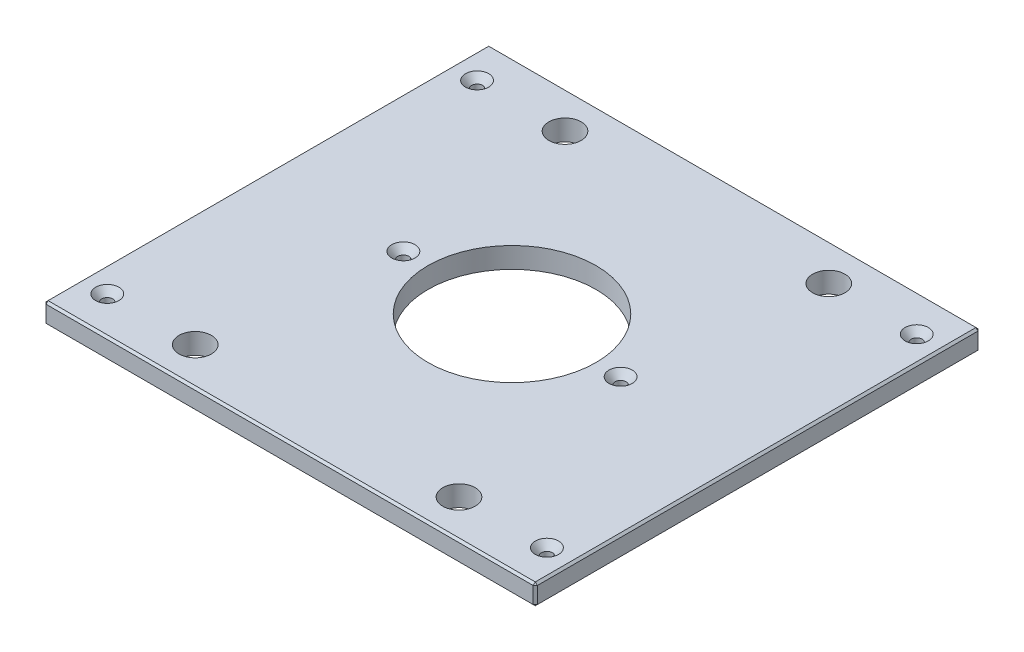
ISO-10303-21;
HEADER;
FILE_DESCRIPTION(('STEP AP214'),'2;1');
FILE_NAME('part.step','',(''),(''),'','','');
FILE_SCHEMA(('AUTOMOTIVE_DESIGN { 1 0 10303 214 1 1 1 1 }'));
ENDSEC;
DATA;
#1=APPLICATION_CONTEXT('core data for automotive mechanical design processes');
#2=APPLICATION_PROTOCOL_DEFINITION('international standard','automotive_design',2000,#1);
#3=PRODUCT_CONTEXT('',#1,'mechanical');
#4=PRODUCT('Part','Part','',(#3));
#5=PRODUCT_RELATED_PRODUCT_CATEGORY('part','',(#4));
#6=PRODUCT_DEFINITION_FORMATION('','',#4);
#7=PRODUCT_DEFINITION_CONTEXT('part definition',#1,'design');
#8=PRODUCT_DEFINITION('design','',#6,#7);
#9=PRODUCT_DEFINITION_SHAPE('','',#8);
#10=(LENGTH_UNIT() NAMED_UNIT(*) SI_UNIT(.MILLI.,.METRE.));
#11=(NAMED_UNIT(*) PLANE_ANGLE_UNIT() SI_UNIT($,.RADIAN.));
#12=(NAMED_UNIT(*) SI_UNIT($,.STERADIAN.) SOLID_ANGLE_UNIT());
#13=UNCERTAINTY_MEASURE_WITH_UNIT(LENGTH_MEASURE(1.E-05),#10,'distance_accuracy_value','');
#14=(GEOMETRIC_REPRESENTATION_CONTEXT(3) GLOBAL_UNCERTAINTY_ASSIGNED_CONTEXT((#13)) GLOBAL_UNIT_ASSIGNED_CONTEXT((#10,
#11,#12)) REPRESENTATION_CONTEXT('',''));
#15=CARTESIAN_POINT('',(0.,0.,0.));
#16=DIRECTION('',(0.,0.,1.));
#17=DIRECTION('',(1.,0.,0.));
#18=AXIS2_PLACEMENT_3D('',#15,#16,#17);
#19=CARTESIAN_POINT('',(-150.8125,12.7,-136.525));
#20=DIRECTION('',(1.,0.,0.));
#21=DIRECTION('',(0.,0.,-1.));
#22=AXIS2_PLACEMENT_3D('',#19,#20,#21);
#23=PLANE('',#22);
#24=DIRECTION('',(0.,0.,-1.));
#25=VECTOR('',#24,1.);
#26=CARTESIAN_POINT('',(-150.8125,11.43,-136.525));
#27=LINE('',#26,#25);
#28=CARTESIAN_POINT('',(-150.8125,11.43,135.255));
#29=VERTEX_POINT('',#28);
#30=CARTESIAN_POINT('',(-150.8125,11.43,-135.255));
#31=VERTEX_POINT('',#30);
#32=EDGE_CURVE('E136',#29,#31,#27,.T.);
#33=ORIENTED_EDGE('',*,*,#32,.T.);
#34=DIRECTION('',(0.,-1.,0.));
#35=VECTOR('',#34,1.);
#36=CARTESIAN_POINT('',(-150.8125,12.7,-135.255));
#37=LINE('',#36,#35);
#38=CARTESIAN_POINT('',(-150.8125,1.26999999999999,-135.255));
#39=VERTEX_POINT('',#38);
#40=EDGE_CURVE('E132',#31,#39,#37,.T.);
#41=ORIENTED_EDGE('',*,*,#40,.T.);
#42=DIRECTION('',(0.,0.,1.));
#43=VECTOR('',#42,1.);
#44=CARTESIAN_POINT('',(-150.8125,1.26999999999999,-136.525));
#45=LINE('',#44,#43);
#46=CARTESIAN_POINT('',(-150.8125,1.26999999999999,135.255));
#47=VERTEX_POINT('',#46);
#48=EDGE_CURVE('E127',#39,#47,#45,.T.);
#49=ORIENTED_EDGE('',*,*,#48,.T.);
#50=DIRECTION('',(0.,1.,0.));
#51=VECTOR('',#50,1.);
#52=CARTESIAN_POINT('',(-150.8125,12.7,135.255));
#53=LINE('',#52,#51);
#54=EDGE_CURVE('E129',#47,#29,#53,.T.);
#55=ORIENTED_EDGE('',*,*,#54,.T.);
#56=EDGE_LOOP('',(#33,#41,#49,#55));
#57=FACE_BOUND('',#56,.T.);
#58=ADVANCED_FACE('F36',(#57),#23,.F.);
#59=CARTESIAN_POINT('',(-150.8125,12.7,136.525));
#60=DIRECTION('',(0.,0.,-1.));
#61=DIRECTION('',(-1.,0.,0.));
#62=AXIS2_PLACEMENT_3D('',#59,#60,#61);
#63=PLANE('',#62);
#64=DIRECTION('',(1.,0.,0.));
#65=VECTOR('',#64,1.);
#66=CARTESIAN_POINT('',(-150.8125,1.26999999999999,136.525));
#67=LINE('',#66,#65);
#68=CARTESIAN_POINT('',(-149.5425,1.26999999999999,136.525));
#69=VERTEX_POINT('',#68);
#70=CARTESIAN_POINT('',(149.5425,1.26999999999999,136.525));
#71=VERTEX_POINT('',#70);
#72=EDGE_CURVE('E59',#69,#71,#67,.T.);
#73=ORIENTED_EDGE('',*,*,#72,.T.);
#74=DIRECTION('',(0.,1.,0.));
#75=VECTOR('',#74,1.);
#76=CARTESIAN_POINT('',(149.5425,12.7,136.525));
#77=LINE('',#76,#75);
#78=CARTESIAN_POINT('',(149.5425,11.43,136.525));
#79=VERTEX_POINT('',#78);
#80=EDGE_CURVE('E11',#71,#79,#77,.T.);
#81=ORIENTED_EDGE('',*,*,#80,.T.);
#82=DIRECTION('',(-1.,0.,0.));
#83=VECTOR('',#82,1.);
#84=CARTESIAN_POINT('',(-150.8125,11.43,136.525));
#85=LINE('',#84,#83);
#86=CARTESIAN_POINT('',(-149.5425,11.43,136.525));
#87=VERTEX_POINT('',#86);
#88=EDGE_CURVE('E45',#79,#87,#85,.T.);
#89=ORIENTED_EDGE('',*,*,#88,.T.);
#90=DIRECTION('',(0.,-1.,0.));
#91=VECTOR('',#90,1.);
#92=CARTESIAN_POINT('',(-149.5425,12.7,136.525));
#93=LINE('',#92,#91);
#94=EDGE_CURVE('E280',#87,#69,#93,.T.);
#95=ORIENTED_EDGE('',*,*,#94,.T.);
#96=EDGE_LOOP('',(#73,#81,#89,#95));
#97=FACE_BOUND('',#96,.T.);
#98=ADVANCED_FACE('F349',(#97),#63,.F.);
#99=CARTESIAN_POINT('',(150.8125,12.7,-136.525));
#100=DIRECTION('',(-1.,0.,0.));
#101=DIRECTION('',(0.,0.,1.));
#102=AXIS2_PLACEMENT_3D('',#99,#100,#101);
#103=PLANE('',#102);
#104=DIRECTION('',(0.,0.,-1.));
#105=VECTOR('',#104,1.);
#106=CARTESIAN_POINT('',(150.8125,1.26999999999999,-136.525));
#107=LINE('',#106,#105);
#108=CARTESIAN_POINT('',(150.8125,1.26999999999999,135.255));
#109=VERTEX_POINT('',#108);
#110=CARTESIAN_POINT('',(150.8125,1.26999999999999,-135.255));
#111=VERTEX_POINT('',#110);
#112=EDGE_CURVE('E275',#109,#111,#107,.T.);
#113=ORIENTED_EDGE('',*,*,#112,.T.);
#114=DIRECTION('',(0.,1.,0.));
#115=VECTOR('',#114,1.);
#116=CARTESIAN_POINT('',(150.8125,12.7,-135.255));
#117=LINE('',#116,#115);
#118=CARTESIAN_POINT('',(150.8125,11.43,-135.255));
#119=VERTEX_POINT('',#118);
#120=EDGE_CURVE('E277',#111,#119,#117,.T.);
#121=ORIENTED_EDGE('',*,*,#120,.T.);
#122=DIRECTION('',(0.,0.,1.));
#123=VECTOR('',#122,1.);
#124=CARTESIAN_POINT('',(150.8125,11.43,136.525));
#125=LINE('',#124,#123);
#126=CARTESIAN_POINT('',(150.8125,11.43,135.255));
#127=VERTEX_POINT('',#126);
#128=EDGE_CURVE('E273',#119,#127,#125,.T.);
#129=ORIENTED_EDGE('',*,*,#128,.T.);
#130=DIRECTION('',(0.,-1.,0.));
#131=VECTOR('',#130,1.);
#132=CARTESIAN_POINT('',(150.8125,12.7,135.255));
#133=LINE('',#132,#131);
#134=EDGE_CURVE('E271',#127,#109,#133,.T.);
#135=ORIENTED_EDGE('',*,*,#134,.T.);
#136=EDGE_LOOP('',(#113,#121,#129,#135));
#137=FACE_BOUND('',#136,.T.);
#138=ADVANCED_FACE('F336',(#137),#103,.F.);
#139=CARTESIAN_POINT('',(-150.8125,12.7,-136.525));
#140=DIRECTION('',(0.,0.,1.));
#141=DIRECTION('',(1.,0.,0.));
#142=AXIS2_PLACEMENT_3D('',#139,#140,#141);
#143=PLANE('',#142);
#144=DIRECTION('',(-1.,0.,0.));
#145=VECTOR('',#144,1.);
#146=CARTESIAN_POINT('',(-150.8125,1.26999999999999,-136.525));
#147=LINE('',#146,#145);
#148=CARTESIAN_POINT('',(149.5425,1.26999999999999,-136.525));
#149=VERTEX_POINT('',#148);
#150=CARTESIAN_POINT('',(-149.5425,1.26999999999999,-136.525));
#151=VERTEX_POINT('',#150);
#152=EDGE_CURVE('E247',#149,#151,#147,.T.);
#153=ORIENTED_EDGE('',*,*,#152,.T.);
#154=DIRECTION('',(0.,1.,0.));
#155=VECTOR('',#154,1.);
#156=CARTESIAN_POINT('',(-149.5425,12.7,-136.525));
#157=LINE('',#156,#155);
#158=CARTESIAN_POINT('',(-149.5425,11.43,-136.525));
#159=VERTEX_POINT('',#158);
#160=EDGE_CURVE('E251',#151,#159,#157,.T.);
#161=ORIENTED_EDGE('',*,*,#160,.T.);
#162=DIRECTION('',(1.,0.,0.));
#163=VECTOR('',#162,1.);
#164=CARTESIAN_POINT('',(150.8125,11.43,-136.525));
#165=LINE('',#164,#163);
#166=CARTESIAN_POINT('',(149.5425,11.43,-136.525));
#167=VERTEX_POINT('',#166);
#168=EDGE_CURVE('E249',#159,#167,#165,.T.);
#169=ORIENTED_EDGE('',*,*,#168,.T.);
#170=DIRECTION('',(0.,-1.,0.));
#171=VECTOR('',#170,1.);
#172=CARTESIAN_POINT('',(149.5425,12.7,-136.525));
#173=LINE('',#172,#171);
#174=EDGE_CURVE('E245',#167,#149,#173,.T.);
#175=ORIENTED_EDGE('',*,*,#174,.T.);
#176=EDGE_LOOP('',(#153,#161,#169,#175));
#177=FACE_BOUND('',#176,.T.);
#178=ADVANCED_FACE('F310',(#177),#143,.F.);
#179=CARTESIAN_POINT('',(0.,12.7,0.));
#180=DIRECTION('',(0.,1.,0.));
#181=DIRECTION('',(0.,0.,1.));
#182=AXIS2_PLACEMENT_3D('',#179,#180,#181);
#183=PLANE('',#182);
#184=CARTESIAN_POINT('',(134.9375,12.7,-113.50498));
#185=DIRECTION('',(0.,1.,0.));
#186=DIRECTION('',(0.,0.,1.));
#187=AXIS2_PLACEMENT_3D('',#184,#185,#186);
#188=CIRCLE('',#187,7.13739999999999);
#189=CARTESIAN_POINT('',(134.9375,12.7,-106.36758));
#190=VERTEX_POINT('',#189);
#191=EDGE_CURVE('E753',#190,#190,#188,.T.);
#192=ORIENTED_EDGE('',*,*,#191,.F.);
#193=EDGE_LOOP('',(#192));
#194=FACE_BOUND('',#193,.T.);
#195=CARTESIAN_POINT('',(134.9375,12.7,113.50498));
#196=DIRECTION('',(0.,1.,0.));
#197=DIRECTION('',(0.,0.,1.));
#198=AXIS2_PLACEMENT_3D('',#195,#196,#197);
#199=CIRCLE('',#198,7.13739999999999);
#200=CARTESIAN_POINT('',(134.9375,12.7,120.64238));
#201=VERTEX_POINT('',#200);
#202=EDGE_CURVE('E757',#201,#201,#199,.T.);
#203=ORIENTED_EDGE('',*,*,#202,.F.);
#204=EDGE_LOOP('',(#203));
#205=FACE_BOUND('',#204,.T.);
#206=CARTESIAN_POINT('',(-134.9375,12.7,113.50498));
#207=DIRECTION('',(0.,1.,0.));
#208=DIRECTION('',(0.,0.,1.));
#209=AXIS2_PLACEMENT_3D('',#206,#207,#208);
#210=CIRCLE('',#209,7.13739999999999);
#211=CARTESIAN_POINT('',(-134.9375,12.7,120.64238));
#212=VERTEX_POINT('',#211);
#213=EDGE_CURVE('E761',#212,#212,#210,.T.);
#214=ORIENTED_EDGE('',*,*,#213,.F.);
#215=EDGE_LOOP('',(#214));
#216=FACE_BOUND('',#215,.T.);
#217=CARTESIAN_POINT('',(-66.675,12.7,0.));
#218=DIRECTION('',(0.,1.,0.));
#219=DIRECTION('',(0.,0.,1.));
#220=AXIS2_PLACEMENT_3D('',#217,#218,#219);
#221=CIRCLE('',#220,7.1374);
#222=CARTESIAN_POINT('',(-66.675,12.7,7.1374));
#223=VERTEX_POINT('',#222);
#224=EDGE_CURVE('E765',#223,#223,#221,.T.);
#225=ORIENTED_EDGE('',*,*,#224,.F.);
#226=EDGE_LOOP('',(#225));
#227=FACE_BOUND('',#226,.T.);
#228=CARTESIAN_POINT('',(66.675,12.7,0.));
#229=DIRECTION('',(0.,1.,0.));
#230=DIRECTION('',(0.,0.,1.));
#231=AXIS2_PLACEMENT_3D('',#228,#229,#230);
#232=CIRCLE('',#231,7.1374);
#233=CARTESIAN_POINT('',(66.675,12.7,7.1374));
#234=VERTEX_POINT('',#233);
#235=EDGE_CURVE('E769',#234,#234,#232,.T.);
#236=ORIENTED_EDGE('',*,*,#235,.F.);
#237=EDGE_LOOP('',(#236));
#238=FACE_BOUND('',#237,.T.);
#239=CARTESIAN_POINT('',(-134.9375,12.7,-113.50498));
#240=DIRECTION('',(0.,1.,0.));
#241=DIRECTION('',(0.,0.,1.));
#242=AXIS2_PLACEMENT_3D('',#239,#240,#241);
#243=CIRCLE('',#242,7.13739999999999);
#244=CARTESIAN_POINT('',(-134.9375,12.7,-106.36758));
#245=VERTEX_POINT('',#244);
#246=EDGE_CURVE('E772',#245,#245,#243,.T.);
#247=ORIENTED_EDGE('',*,*,#246,.F.);
#248=EDGE_LOOP('',(#247));
#249=FACE_BOUND('',#248,.T.);
#250=DIRECTION('',(0.,0.,-1.));
#251=VECTOR('',#250,1.);
#252=CARTESIAN_POINT('',(149.5425,12.7,-136.525));
#253=LINE('',#252,#251);
#254=CARTESIAN_POINT('',(149.5425,12.7,135.255));
#255=VERTEX_POINT('',#254);
#256=CARTESIAN_POINT('',(149.5425,12.7,-135.255));
#257=VERTEX_POINT('',#256);
#258=EDGE_CURVE('E258',#255,#257,#253,.T.);
#259=ORIENTED_EDGE('',*,*,#258,.T.);
#260=DIRECTION('',(-1.,0.,0.));
#261=VECTOR('',#260,1.);
#262=CARTESIAN_POINT('',(-150.8125,12.7,-135.255));
#263=LINE('',#262,#261);
#264=CARTESIAN_POINT('',(-149.5425,12.7,-135.255));
#265=VERTEX_POINT('',#264);
#266=EDGE_CURVE('E260',#257,#265,#263,.T.);
#267=ORIENTED_EDGE('',*,*,#266,.T.);
#268=DIRECTION('',(0.,0.,1.));
#269=VECTOR('',#268,1.);
#270=CARTESIAN_POINT('',(-149.5425,12.7,136.525));
#271=LINE('',#270,#269);
#272=CARTESIAN_POINT('',(-149.5425,12.7,135.255));
#273=VERTEX_POINT('',#272);
#274=EDGE_CURVE('E256',#265,#273,#271,.T.);
#275=ORIENTED_EDGE('',*,*,#274,.T.);
#276=DIRECTION('',(1.,0.,0.));
#277=VECTOR('',#276,1.);
#278=CARTESIAN_POINT('',(150.8125,12.7,135.255));
#279=LINE('',#278,#277);
#280=EDGE_CURVE('E254',#273,#255,#279,.T.);
#281=ORIENTED_EDGE('',*,*,#280,.T.);
#282=EDGE_LOOP('',(#259,#267,#275,#281));
#283=FACE_BOUND('',#282,.T.);
#284=CARTESIAN_POINT('',(80.9625,12.7,-113.50498));
#285=DIRECTION('',(0.,1.,0.));
#286=DIRECTION('',(0.,0.,1.));
#287=AXIS2_PLACEMENT_3D('',#284,#285,#286);
#288=CIRCLE('',#287,9.921875);
#289=CARTESIAN_POINT('',(80.9625,12.7,-103.583105));
#290=VERTEX_POINT('',#289);
#291=EDGE_CURVE('E205',#290,#290,#288,.T.);
#292=ORIENTED_EDGE('',*,*,#291,.F.);
#293=EDGE_LOOP('',(#292));
#294=FACE_BOUND('',#293,.T.);
#295=CARTESIAN_POINT('',(-80.9625,12.7,-113.50498));
#296=DIRECTION('',(0.,1.,0.));
#297=DIRECTION('',(0.,0.,1.));
#298=AXIS2_PLACEMENT_3D('',#295,#296,#297);
#299=CIRCLE('',#298,9.921875);
#300=CARTESIAN_POINT('',(-80.9625,12.7,-103.583105));
#301=VERTEX_POINT('',#300);
#302=EDGE_CURVE('E215',#301,#301,#299,.T.);
#303=ORIENTED_EDGE('',*,*,#302,.F.);
#304=EDGE_LOOP('',(#303));
#305=FACE_BOUND('',#304,.T.);
#306=CARTESIAN_POINT('',(80.9625,12.7,113.50498));
#307=DIRECTION('',(0.,1.,0.));
#308=DIRECTION('',(0.,0.,1.));
#309=AXIS2_PLACEMENT_3D('',#306,#307,#308);
#310=CIRCLE('',#309,9.921875);
#311=CARTESIAN_POINT('',(80.9625,12.7,123.426855));
#312=VERTEX_POINT('',#311);
#313=EDGE_CURVE('E226',#312,#312,#310,.T.);
#314=ORIENTED_EDGE('',*,*,#313,.F.);
#315=EDGE_LOOP('',(#314));
#316=FACE_BOUND('',#315,.T.);
#317=CARTESIAN_POINT('',(-80.9625,12.7,113.50498));
#318=DIRECTION('',(0.,1.,0.));
#319=DIRECTION('',(0.,0.,1.));
#320=AXIS2_PLACEMENT_3D('',#317,#318,#319);
#321=CIRCLE('',#320,9.921875);
#322=CARTESIAN_POINT('',(-80.9625,12.7,123.426855));
#323=VERTEX_POINT('',#322);
#324=EDGE_CURVE('E232',#323,#323,#321,.T.);
#325=ORIENTED_EDGE('',*,*,#324,.F.);
#326=EDGE_LOOP('',(#325));
#327=FACE_BOUND('',#326,.T.);
#328=CARTESIAN_POINT('',(0.,12.7,0.));
#329=DIRECTION('',(0.,1.,0.));
#330=DIRECTION('',(0.,0.,1.));
#331=AXIS2_PLACEMENT_3D('',#328,#329,#330);
#332=CIRCLE('',#331,51.562);
#333=CARTESIAN_POINT('',(0.,12.7,51.562));
#334=VERTEX_POINT('',#333);
#335=EDGE_CURVE('E238',#334,#334,#332,.T.);
#336=ORIENTED_EDGE('',*,*,#335,.F.);
#337=EDGE_LOOP('',(#336));
#338=FACE_BOUND('',#337,.T.);
#339=ADVANCED_FACE('F358',(#194,#205,#216,#227,#238,#249,#283,#294,#305,#316,#327,#338),#183,.T.);
#340=CARTESIAN_POINT('',(0.,0.,0.));
#341=DIRECTION('',(0.,1.,0.));
#342=DIRECTION('',(0.,0.,1.));
#343=AXIS2_PLACEMENT_3D('',#340,#341,#342);
#344=PLANE('',#343);
#345=CARTESIAN_POINT('',(134.9375,0.,-113.50498));
#346=DIRECTION('',(0.,1.,0.));
#347=DIRECTION('',(0.,0.,1.));
#348=AXIS2_PLACEMENT_3D('',#345,#346,#347);
#349=CIRCLE('',#348,3.3782);
#350=CARTESIAN_POINT('',(134.9375,0.,-110.12678));
#351=VERTEX_POINT('',#350);
#352=EDGE_CURVE('E806',#351,#351,#349,.T.);
#353=ORIENTED_EDGE('',*,*,#352,.T.);
#354=EDGE_LOOP('',(#353));
#355=FACE_BOUND('',#354,.T.);
#356=CARTESIAN_POINT('',(134.9375,0.,113.50498));
#357=DIRECTION('',(0.,1.,0.));
#358=DIRECTION('',(0.,0.,1.));
#359=AXIS2_PLACEMENT_3D('',#356,#357,#358);
#360=CIRCLE('',#359,3.3782);
#361=CARTESIAN_POINT('',(134.9375,0.,116.88318));
#362=VERTEX_POINT('',#361);
#363=EDGE_CURVE('E799',#362,#362,#360,.T.);
#364=ORIENTED_EDGE('',*,*,#363,.T.);
#365=EDGE_LOOP('',(#364));
#366=FACE_BOUND('',#365,.T.);
#367=CARTESIAN_POINT('',(-134.9375,0.,113.50498));
#368=DIRECTION('',(0.,1.,0.));
#369=DIRECTION('',(0.,0.,1.));
#370=AXIS2_PLACEMENT_3D('',#367,#368,#369);
#371=CIRCLE('',#370,3.3782);
#372=CARTESIAN_POINT('',(-134.9375,0.,116.88318));
#373=VERTEX_POINT('',#372);
#374=EDGE_CURVE('E792',#373,#373,#371,.T.);
#375=ORIENTED_EDGE('',*,*,#374,.T.);
#376=EDGE_LOOP('',(#375));
#377=FACE_BOUND('',#376,.T.);
#378=CARTESIAN_POINT('',(-66.675,0.,0.));
#379=DIRECTION('',(0.,1.,0.));
#380=DIRECTION('',(0.,0.,1.));
#381=AXIS2_PLACEMENT_3D('',#378,#379,#380);
#382=CIRCLE('',#381,3.3782);
#383=CARTESIAN_POINT('',(-66.675,0.,3.3782));
#384=VERTEX_POINT('',#383);
#385=EDGE_CURVE('E785',#384,#384,#382,.T.);
#386=ORIENTED_EDGE('',*,*,#385,.T.);
#387=EDGE_LOOP('',(#386));
#388=FACE_BOUND('',#387,.T.);
#389=CARTESIAN_POINT('',(66.675,0.,0.));
#390=DIRECTION('',(0.,1.,0.));
#391=DIRECTION('',(0.,0.,1.));
#392=AXIS2_PLACEMENT_3D('',#389,#390,#391);
#393=CIRCLE('',#392,3.3782);
#394=CARTESIAN_POINT('',(66.675,0.,3.3782));
#395=VERTEX_POINT('',#394);
#396=EDGE_CURVE('E775',#395,#395,#393,.T.);
#397=ORIENTED_EDGE('',*,*,#396,.T.);
#398=EDGE_LOOP('',(#397));
#399=FACE_BOUND('',#398,.T.);
#400=CARTESIAN_POINT('',(-134.9375,0.,-113.50498));
#401=DIRECTION('',(0.,1.,0.));
#402=DIRECTION('',(0.,0.,1.));
#403=AXIS2_PLACEMENT_3D('',#400,#401,#402);
#404=CIRCLE('',#403,3.3782);
#405=CARTESIAN_POINT('',(-134.9375,0.,-110.12678));
#406=VERTEX_POINT('',#405);
#407=EDGE_CURVE('E218',#406,#406,#404,.T.);
#408=ORIENTED_EDGE('',*,*,#407,.T.);
#409=EDGE_LOOP('',(#408));
#410=FACE_BOUND('',#409,.T.);
#411=DIRECTION('',(0.,0.,-1.));
#412=VECTOR('',#411,1.);
#413=CARTESIAN_POINT('',(-149.5425,0.,0.));
#414=LINE('',#413,#412);
#415=CARTESIAN_POINT('',(-149.5425,0.,135.255));
#416=VERTEX_POINT('',#415);
#417=CARTESIAN_POINT('',(-149.5425,0.,-135.255));
#418=VERTEX_POINT('',#417);
#419=EDGE_CURVE('E159',#416,#418,#414,.T.);
#420=ORIENTED_EDGE('',*,*,#419,.T.);
#421=DIRECTION('',(1.,0.,0.));
#422=VECTOR('',#421,1.);
#423=CARTESIAN_POINT('',(0.,0.,-135.255));
#424=LINE('',#423,#422);
#425=CARTESIAN_POINT('',(149.5425,0.,-135.255));
#426=VERTEX_POINT('',#425);
#427=EDGE_CURVE('E268',#418,#426,#424,.T.);
#428=ORIENTED_EDGE('',*,*,#427,.T.);
#429=DIRECTION('',(0.,0.,1.));
#430=VECTOR('',#429,1.);
#431=CARTESIAN_POINT('',(149.5425,0.,0.));
#432=LINE('',#431,#430);
#433=CARTESIAN_POINT('',(149.5425,0.,135.255));
#434=VERTEX_POINT('',#433);
#435=EDGE_CURVE('E266',#426,#434,#432,.T.);
#436=ORIENTED_EDGE('',*,*,#435,.T.);
#437=DIRECTION('',(-1.,0.,0.));
#438=VECTOR('',#437,1.);
#439=CARTESIAN_POINT('',(0.,0.,135.255));
#440=LINE('',#439,#438);
#441=EDGE_CURVE('E263',#434,#416,#440,.T.);
#442=ORIENTED_EDGE('',*,*,#441,.T.);
#443=EDGE_LOOP('',(#420,#428,#436,#442));
#444=FACE_BOUND('',#443,.T.);
#445=CARTESIAN_POINT('',(80.9625,0.,-113.50498));
#446=DIRECTION('',(0.,1.,0.));
#447=DIRECTION('',(0.,0.,1.));
#448=AXIS2_PLACEMENT_3D('',#445,#446,#447);
#449=CIRCLE('',#448,9.921875);
#450=CARTESIAN_POINT('',(80.9625,0.,-103.583105));
#451=VERTEX_POINT('',#450);
#452=EDGE_CURVE('E210',#451,#451,#449,.T.);
#453=ORIENTED_EDGE('',*,*,#452,.T.);
#454=EDGE_LOOP('',(#453));
#455=FACE_BOUND('',#454,.T.);
#456=CARTESIAN_POINT('',(-80.9625,0.,-113.50498));
#457=DIRECTION('',(0.,1.,0.));
#458=DIRECTION('',(0.,0.,1.));
#459=AXIS2_PLACEMENT_3D('',#456,#457,#458);
#460=CIRCLE('',#459,9.921875);
#461=CARTESIAN_POINT('',(-80.9625,0.,-103.583105));
#462=VERTEX_POINT('',#461);
#463=EDGE_CURVE('E223',#462,#462,#460,.T.);
#464=ORIENTED_EDGE('',*,*,#463,.T.);
#465=EDGE_LOOP('',(#464));
#466=FACE_BOUND('',#465,.T.);
#467=CARTESIAN_POINT('',(80.9625,0.,113.50498));
#468=DIRECTION('',(0.,1.,0.));
#469=DIRECTION('',(0.,0.,1.));
#470=AXIS2_PLACEMENT_3D('',#467,#468,#469);
#471=CIRCLE('',#470,9.921875);
#472=CARTESIAN_POINT('',(80.9625,0.,123.426855));
#473=VERTEX_POINT('',#472);
#474=EDGE_CURVE('E229',#473,#473,#471,.T.);
#475=ORIENTED_EDGE('',*,*,#474,.T.);
#476=EDGE_LOOP('',(#475));
#477=FACE_BOUND('',#476,.T.);
#478=CARTESIAN_POINT('',(-80.9625,0.,113.50498));
#479=DIRECTION('',(0.,1.,0.));
#480=DIRECTION('',(0.,0.,1.));
#481=AXIS2_PLACEMENT_3D('',#478,#479,#480);
#482=CIRCLE('',#481,9.921875);
#483=CARTESIAN_POINT('',(-80.9625,0.,123.426855));
#484=VERTEX_POINT('',#483);
#485=EDGE_CURVE('E235',#484,#484,#482,.T.);
#486=ORIENTED_EDGE('',*,*,#485,.T.);
#487=EDGE_LOOP('',(#486));
#488=FACE_BOUND('',#487,.T.);
#489=CARTESIAN_POINT('',(0.,0.,0.));
#490=DIRECTION('',(0.,1.,0.));
#491=DIRECTION('',(0.,0.,1.));
#492=AXIS2_PLACEMENT_3D('',#489,#490,#491);
#493=CIRCLE('',#492,51.562);
#494=CARTESIAN_POINT('',(0.,0.,51.562));
#495=VERTEX_POINT('',#494);
#496=EDGE_CURVE('E148',#495,#495,#493,.T.);
#497=ORIENTED_EDGE('',*,*,#496,.T.);
#498=EDGE_LOOP('',(#497));
#499=FACE_BOUND('',#498,.T.);
#500=ADVANCED_FACE('F323',(#355,#366,#377,#388,#399,#410,#444,#455,#466,#477,#488,#499),#344,.F.);
#501=CARTESIAN_POINT('',(0.,0.,0.));
#502=DIRECTION('',(0.,1.,0.));
#503=DIRECTION('',(0.,0.,1.));
#504=AXIS2_PLACEMENT_3D('',#501,#502,#503);
#505=CYLINDRICAL_SURFACE('',#504,51.562);
#506=ORIENTED_EDGE('',*,*,#496,.F.);
#507=EDGE_LOOP('',(#506));
#508=FACE_BOUND('',#507,.T.);
#509=ORIENTED_EDGE('',*,*,#335,.T.);
#510=EDGE_LOOP('',(#509));
#511=FACE_BOUND('',#510,.T.);
#512=ADVANCED_FACE('F692',(#508,#511),#505,.F.);
#513=CARTESIAN_POINT('',(-80.9625,12.7,113.50498));
#514=DIRECTION('',(0.,1.,0.));
#515=DIRECTION('',(0.,0.,1.));
#516=AXIS2_PLACEMENT_3D('',#513,#514,#515);
#517=CYLINDRICAL_SURFACE('',#516,9.921875);
#518=ORIENTED_EDGE('',*,*,#485,.F.);
#519=EDGE_LOOP('',(#518));
#520=FACE_BOUND('',#519,.T.);
#521=ORIENTED_EDGE('',*,*,#324,.T.);
#522=EDGE_LOOP('',(#521));
#523=FACE_BOUND('',#522,.T.);
#524=ADVANCED_FACE('F683',(#520,#523),#517,.F.);
#525=CARTESIAN_POINT('',(80.9625,12.7,113.50498));
#526=DIRECTION('',(0.,1.,0.));
#527=DIRECTION('',(0.,0.,1.));
#528=AXIS2_PLACEMENT_3D('',#525,#526,#527);
#529=CYLINDRICAL_SURFACE('',#528,9.921875);
#530=ORIENTED_EDGE('',*,*,#474,.F.);
#531=EDGE_LOOP('',(#530));
#532=FACE_BOUND('',#531,.T.);
#533=ORIENTED_EDGE('',*,*,#313,.T.);
#534=EDGE_LOOP('',(#533));
#535=FACE_BOUND('',#534,.T.);
#536=ADVANCED_FACE('F674',(#532,#535),#529,.F.);
#537=CARTESIAN_POINT('',(-80.9625,12.7,-113.50498));
#538=DIRECTION('',(0.,1.,0.));
#539=DIRECTION('',(0.,0.,1.));
#540=AXIS2_PLACEMENT_3D('',#537,#538,#539);
#541=CYLINDRICAL_SURFACE('',#540,9.921875);
#542=ORIENTED_EDGE('',*,*,#463,.F.);
#543=EDGE_LOOP('',(#542));
#544=FACE_BOUND('',#543,.T.);
#545=ORIENTED_EDGE('',*,*,#302,.T.);
#546=EDGE_LOOP('',(#545));
#547=FACE_BOUND('',#546,.T.);
#548=ADVANCED_FACE('F664',(#544,#547),#541,.F.);
#549=CARTESIAN_POINT('',(80.9625,12.7,-113.50498));
#550=DIRECTION('',(0.,1.,0.));
#551=DIRECTION('',(0.,0.,1.));
#552=AXIS2_PLACEMENT_3D('',#549,#550,#551);
#553=CYLINDRICAL_SURFACE('',#552,9.921875);
#554=ORIENTED_EDGE('',*,*,#452,.F.);
#555=EDGE_LOOP('',(#554));
#556=FACE_BOUND('',#555,.T.);
#557=ORIENTED_EDGE('',*,*,#291,.T.);
#558=EDGE_LOOP('',(#557));
#559=FACE_BOUND('',#558,.T.);
#560=ADVANCED_FACE('F367',(#556,#559),#553,.F.);
#561=CARTESIAN_POINT('',(150.8125,12.7,135.255));
#562=DIRECTION('',(-0.707106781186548,0.,-0.707106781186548));
#563=DIRECTION('',(0.,-1.,0.));
#564=AXIS2_PLACEMENT_3D('',#561,#562,#563);
#565=PLANE('',#564);
#566=DIRECTION('',(-0.707106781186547,0.,0.707106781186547));
#567=VECTOR('',#566,1.);
#568=CARTESIAN_POINT('',(150.8125,11.43,135.255));
#569=LINE('',#568,#567);
#570=EDGE_CURVE('E40',#79,#127,#569,.F.);
#571=ORIENTED_EDGE('',*,*,#570,.F.);
#572=ORIENTED_EDGE('',*,*,#80,.F.);
#573=DIRECTION('',(0.707106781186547,0.,-0.707106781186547));
#574=VECTOR('',#573,1.);
#575=CARTESIAN_POINT('',(150.1775,1.26999999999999,135.89));
#576=LINE('',#575,#574);
#577=EDGE_CURVE('E198',#109,#71,#576,.F.);
#578=ORIENTED_EDGE('',*,*,#577,.F.);
#579=ORIENTED_EDGE('',*,*,#134,.F.);
#580=EDGE_LOOP('',(#571,#572,#578,#579));
#581=FACE_BOUND('',#580,.T.);
#582=ADVANCED_FACE('F38',(#581),#565,.F.);
#583=CARTESIAN_POINT('',(150.8125,11.43,135.255));
#584=DIRECTION('',(0.577350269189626,0.577350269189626,0.577350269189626));
#585=DIRECTION('',(0.707106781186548,0.,-0.707106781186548));
#586=AXIS2_PLACEMENT_3D('',#583,#584,#585);
#587=PLANE('',#586);
#588=DIRECTION('',(0.,-0.707106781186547,0.707106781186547));
#589=VECTOR('',#588,1.);
#590=CARTESIAN_POINT('',(149.5425,12.065,135.89));
#591=LINE('',#590,#589);
#592=EDGE_CURVE('E194',#79,#255,#591,.F.);
#593=ORIENTED_EDGE('',*,*,#592,.F.);
#594=ORIENTED_EDGE('',*,*,#570,.T.);
#595=DIRECTION('',(-0.707106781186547,0.707106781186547,0.));
#596=VECTOR('',#595,1.);
#597=CARTESIAN_POINT('',(150.8125,11.43,135.255));
#598=LINE('',#597,#596);
#599=EDGE_CURVE('E196',#255,#127,#598,.F.);
#600=ORIENTED_EDGE('',*,*,#599,.F.);
#601=EDGE_LOOP('',(#593,#594,#600));
#602=FACE_BOUND('',#601,.T.);
#603=ADVANCED_FACE('F360',(#602),#587,.T.);
#604=CARTESIAN_POINT('',(149.5425,0.,135.255));
#605=DIRECTION('',(0.577350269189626,-0.577350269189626,0.577350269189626));
#606=DIRECTION('',(0.707106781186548,0.,-0.707106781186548));
#607=AXIS2_PLACEMENT_3D('',#604,#605,#606);
#608=PLANE('',#607);
#609=DIRECTION('',(-0.707106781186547,-0.707106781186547,0.));
#610=VECTOR('',#609,1.);
#611=CARTESIAN_POINT('',(149.5425,0.,135.255));
#612=LINE('',#611,#610);
#613=EDGE_CURVE('E188',#109,#434,#612,.T.);
#614=ORIENTED_EDGE('',*,*,#613,.F.);
#615=ORIENTED_EDGE('',*,*,#577,.T.);
#616=DIRECTION('',(0.,0.707106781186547,0.707106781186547));
#617=VECTOR('',#616,1.);
#618=CARTESIAN_POINT('',(149.5425,0.,135.255));
#619=LINE('',#618,#617);
#620=EDGE_CURVE('E191',#434,#71,#619,.T.);
#621=ORIENTED_EDGE('',*,*,#620,.F.);
#622=EDGE_LOOP('',(#614,#615,#621));
#623=FACE_BOUND('',#622,.T.);
#624=ADVANCED_FACE('F329',(#623),#608,.T.);
#625=CARTESIAN_POINT('',(149.5425,12.7,0.));
#626=DIRECTION('',(0.707106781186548,0.707106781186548,0.));
#627=DIRECTION('',(0.,0.,1.));
#628=AXIS2_PLACEMENT_3D('',#625,#626,#627);
#629=PLANE('',#628);
#630=ORIENTED_EDGE('',*,*,#599,.T.);
#631=ORIENTED_EDGE('',*,*,#128,.F.);
#632=DIRECTION('',(0.707106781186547,-0.707106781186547,0.));
#633=VECTOR('',#632,1.);
#634=CARTESIAN_POINT('',(150.1775,12.065,-135.255));
#635=LINE('',#634,#633);
#636=EDGE_CURVE('E183',#257,#119,#635,.T.);
#637=ORIENTED_EDGE('',*,*,#636,.F.);
#638=ORIENTED_EDGE('',*,*,#258,.F.);
#639=EDGE_LOOP('',(#630,#631,#637,#638));
#640=FACE_BOUND('',#639,.T.);
#641=ADVANCED_FACE('F346',(#640),#629,.T.);
#642=CARTESIAN_POINT('',(0.,12.7,135.255));
#643=DIRECTION('',(0.,0.707106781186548,0.707106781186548));
#644=DIRECTION('',(-1.,0.,0.));
#645=AXIS2_PLACEMENT_3D('',#642,#643,#644);
#646=PLANE('',#645);
#647=ORIENTED_EDGE('',*,*,#592,.T.);
#648=ORIENTED_EDGE('',*,*,#280,.F.);
#649=DIRECTION('',(0.,0.707106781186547,-0.707106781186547));
#650=VECTOR('',#649,1.);
#651=CARTESIAN_POINT('',(-149.5425,12.7,135.255));
#652=LINE('',#651,#650);
#653=EDGE_CURVE('E180',#87,#273,#652,.T.);
#654=ORIENTED_EDGE('',*,*,#653,.F.);
#655=ORIENTED_EDGE('',*,*,#88,.F.);
#656=EDGE_LOOP('',(#647,#648,#654,#655));
#657=FACE_BOUND('',#656,.T.);
#658=ADVANCED_FACE('F351',(#657),#646,.T.);
#659=CARTESIAN_POINT('',(-149.5425,12.7,136.525));
#660=DIRECTION('',(0.707106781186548,0.,-0.707106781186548));
#661=DIRECTION('',(0.,-1.,0.));
#662=AXIS2_PLACEMENT_3D('',#659,#660,#661);
#663=PLANE('',#662);
#664=DIRECTION('',(0.707106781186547,0.,0.707106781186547));
#665=VECTOR('',#664,1.);
#666=CARTESIAN_POINT('',(-150.8125,1.26999999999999,135.255));
#667=LINE('',#666,#665);
#668=EDGE_CURVE('E143',#69,#47,#667,.F.);
#669=ORIENTED_EDGE('',*,*,#668,.F.);
#670=ORIENTED_EDGE('',*,*,#94,.F.);
#671=DIRECTION('',(-0.707106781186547,0.,-0.707106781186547));
#672=VECTOR('',#671,1.);
#673=CARTESIAN_POINT('',(-150.1775,11.43,135.89));
#674=LINE('',#673,#672);
#675=EDGE_CURVE('E146',#29,#87,#674,.F.);
#676=ORIENTED_EDGE('',*,*,#675,.F.);
#677=ORIENTED_EDGE('',*,*,#54,.F.);
#678=EDGE_LOOP('',(#669,#670,#676,#677));
#679=FACE_BOUND('',#678,.T.);
#680=ADVANCED_FACE('F141',(#679),#663,.F.);
#681=CARTESIAN_POINT('',(-150.8125,1.26999999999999,136.525));
#682=DIRECTION('',(0.,0.707106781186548,-0.707106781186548));
#683=DIRECTION('',(1.,0.,0.));
#684=AXIS2_PLACEMENT_3D('',#681,#682,#683);
#685=PLANE('',#684);
#686=ORIENTED_EDGE('',*,*,#620,.T.);
#687=ORIENTED_EDGE('',*,*,#72,.F.);
#688=DIRECTION('',(0.,-0.707106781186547,-0.707106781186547));
#689=VECTOR('',#688,1.);
#690=CARTESIAN_POINT('',(-149.5425,0.634999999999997,135.89));
#691=LINE('',#690,#689);
#692=EDGE_CURVE('E156',#416,#69,#691,.F.);
#693=ORIENTED_EDGE('',*,*,#692,.F.);
#694=ORIENTED_EDGE('',*,*,#441,.F.);
#695=EDGE_LOOP('',(#686,#687,#693,#694));
#696=FACE_BOUND('',#695,.T.);
#697=ADVANCED_FACE('F328',(#696),#685,.F.);
#698=CARTESIAN_POINT('',(150.8125,1.26999999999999,-136.525));
#699=DIRECTION('',(-0.707106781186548,0.707106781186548,0.));
#700=DIRECTION('',(0.,0.,-1.));
#701=AXIS2_PLACEMENT_3D('',#698,#699,#700);
#702=PLANE('',#701);
#703=ORIENTED_EDGE('',*,*,#613,.T.);
#704=ORIENTED_EDGE('',*,*,#435,.F.);
#705=DIRECTION('',(0.707106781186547,0.707106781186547,0.));
#706=VECTOR('',#705,1.);
#707=CARTESIAN_POINT('',(149.5425,0.,-135.255));
#708=LINE('',#707,#706);
#709=EDGE_CURVE('E175',#111,#426,#708,.F.);
#710=ORIENTED_EDGE('',*,*,#709,.F.);
#711=ORIENTED_EDGE('',*,*,#112,.F.);
#712=EDGE_LOOP('',(#703,#704,#710,#711));
#713=FACE_BOUND('',#712,.T.);
#714=ADVANCED_FACE('F333',(#713),#702,.F.);
#715=CARTESIAN_POINT('',(149.5425,12.7,-136.525));
#716=DIRECTION('',(-0.707106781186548,0.,0.707106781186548));
#717=DIRECTION('',(0.,-1.,0.));
#718=AXIS2_PLACEMENT_3D('',#715,#716,#717);
#719=PLANE('',#718);
#720=DIRECTION('',(0.707106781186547,0.,0.707106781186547));
#721=VECTOR('',#720,1.);
#722=CARTESIAN_POINT('',(149.5425,11.43,-136.525));
#723=LINE('',#722,#721);
#724=EDGE_CURVE('E185',#119,#167,#723,.F.);
#725=ORIENTED_EDGE('',*,*,#724,.F.);
#726=ORIENTED_EDGE('',*,*,#120,.F.);
#727=DIRECTION('',(-0.707106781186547,0.,-0.707106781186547));
#728=VECTOR('',#727,1.);
#729=CARTESIAN_POINT('',(150.1775,1.26999999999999,-135.89));
#730=LINE('',#729,#728);
#731=EDGE_CURVE('E172',#149,#111,#730,.F.);
#732=ORIENTED_EDGE('',*,*,#731,.F.);
#733=ORIENTED_EDGE('',*,*,#174,.F.);
#734=EDGE_LOOP('',(#725,#726,#732,#733));
#735=FACE_BOUND('',#734,.T.);
#736=ADVANCED_FACE('F341',(#735),#719,.F.);
#737=CARTESIAN_POINT('',(149.5425,11.43,-136.525));
#738=DIRECTION('',(0.577350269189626,0.577350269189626,-0.577350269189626));
#739=DIRECTION('',(-0.707106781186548,0.,-0.707106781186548));
#740=AXIS2_PLACEMENT_3D('',#737,#738,#739);
#741=PLANE('',#740);
#742=ORIENTED_EDGE('',*,*,#636,.T.);
#743=ORIENTED_EDGE('',*,*,#724,.T.);
#744=DIRECTION('',(0.,0.707106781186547,0.707106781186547));
#745=VECTOR('',#744,1.);
#746=CARTESIAN_POINT('',(149.5425,11.43,-136.525));
#747=LINE('',#746,#745);
#748=EDGE_CURVE('E164',#257,#167,#747,.F.);
#749=ORIENTED_EDGE('',*,*,#748,.F.);
#750=EDGE_LOOP('',(#742,#743,#749));
#751=FACE_BOUND('',#750,.T.);
#752=ADVANCED_FACE('F399',(#751),#741,.T.);
#753=CARTESIAN_POINT('',(-149.5425,12.7,135.255));
#754=DIRECTION('',(-0.577350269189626,0.577350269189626,0.577350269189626));
#755=DIRECTION('',(0.707106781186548,0.,0.707106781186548));
#756=AXIS2_PLACEMENT_3D('',#753,#754,#755);
#757=PLANE('',#756);
#758=ORIENTED_EDGE('',*,*,#675,.T.);
#759=ORIENTED_EDGE('',*,*,#653,.T.);
#760=DIRECTION('',(-0.707106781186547,-0.707106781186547,0.));
#761=VECTOR('',#760,1.);
#762=CARTESIAN_POINT('',(-149.5425,12.7,135.255));
#763=LINE('',#762,#761);
#764=EDGE_CURVE('E160',#29,#273,#763,.F.);
#765=ORIENTED_EDGE('',*,*,#764,.F.);
#766=EDGE_LOOP('',(#758,#759,#765));
#767=FACE_BOUND('',#766,.T.);
#768=ADVANCED_FACE('F353',(#767),#757,.T.);
#769=CARTESIAN_POINT('',(-150.8125,1.26999999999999,135.255));
#770=DIRECTION('',(-0.577350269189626,-0.577350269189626,0.577350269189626));
#771=DIRECTION('',(0.707106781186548,0.,0.707106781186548));
#772=AXIS2_PLACEMENT_3D('',#769,#770,#771);
#773=PLANE('',#772);
#774=ORIENTED_EDGE('',*,*,#692,.T.);
#775=ORIENTED_EDGE('',*,*,#668,.T.);
#776=DIRECTION('',(-0.707106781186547,0.707106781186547,0.));
#777=VECTOR('',#776,1.);
#778=CARTESIAN_POINT('',(-150.8125,1.26999999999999,135.255));
#779=LINE('',#778,#777);
#780=EDGE_CURVE('E153',#416,#47,#779,.T.);
#781=ORIENTED_EDGE('',*,*,#780,.F.);
#782=EDGE_LOOP('',(#774,#775,#781));
#783=FACE_BOUND('',#782,.T.);
#784=ADVANCED_FACE('F152',(#783),#773,.T.);
#785=CARTESIAN_POINT('',(149.5425,0.,-135.255));
#786=DIRECTION('',(0.577350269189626,-0.577350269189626,-0.577350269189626));
#787=DIRECTION('',(-0.707106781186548,0.,-0.707106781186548));
#788=AXIS2_PLACEMENT_3D('',#785,#786,#787);
#789=PLANE('',#788);
#790=ORIENTED_EDGE('',*,*,#731,.T.);
#791=ORIENTED_EDGE('',*,*,#709,.T.);
#792=DIRECTION('',(0.,-0.707106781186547,0.707106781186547));
#793=VECTOR('',#792,1.);
#794=CARTESIAN_POINT('',(149.5425,0.,-135.255));
#795=LINE('',#794,#793);
#796=EDGE_CURVE('E161',#149,#426,#795,.T.);
#797=ORIENTED_EDGE('',*,*,#796,.F.);
#798=EDGE_LOOP('',(#790,#791,#797));
#799=FACE_BOUND('',#798,.T.);
#800=ADVANCED_FACE('F391',(#799),#789,.T.);
#801=CARTESIAN_POINT('',(0.,12.7,-135.255));
#802=DIRECTION('',(0.,0.707106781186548,-0.707106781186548));
#803=DIRECTION('',(1.,0.,0.));
#804=AXIS2_PLACEMENT_3D('',#801,#802,#803);
#805=PLANE('',#804);
#806=ORIENTED_EDGE('',*,*,#748,.T.);
#807=ORIENTED_EDGE('',*,*,#168,.F.);
#808=DIRECTION('',(0.,-0.707106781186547,-0.707106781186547));
#809=VECTOR('',#808,1.);
#810=CARTESIAN_POINT('',(-149.5425,11.43,-136.525));
#811=LINE('',#810,#809);
#812=EDGE_CURVE('E166',#265,#159,#811,.T.);
#813=ORIENTED_EDGE('',*,*,#812,.F.);
#814=ORIENTED_EDGE('',*,*,#266,.F.);
#815=EDGE_LOOP('',(#806,#807,#813,#814));
#816=FACE_BOUND('',#815,.T.);
#817=ADVANCED_FACE('F305',(#816),#805,.T.);
#818=CARTESIAN_POINT('',(-149.5425,12.7,0.));
#819=DIRECTION('',(-0.707106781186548,0.707106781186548,0.));
#820=DIRECTION('',(0.,0.,-1.));
#821=AXIS2_PLACEMENT_3D('',#818,#819,#820);
#822=PLANE('',#821);
#823=ORIENTED_EDGE('',*,*,#764,.T.);
#824=ORIENTED_EDGE('',*,*,#274,.F.);
#825=DIRECTION('',(0.707106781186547,0.707106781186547,0.));
#826=VECTOR('',#825,1.);
#827=CARTESIAN_POINT('',(-150.1775,12.065,-135.255));
#828=LINE('',#827,#826);
#829=EDGE_CURVE('E294',#31,#265,#828,.T.);
#830=ORIENTED_EDGE('',*,*,#829,.F.);
#831=ORIENTED_EDGE('',*,*,#32,.F.);
#832=EDGE_LOOP('',(#823,#824,#830,#831));
#833=FACE_BOUND('',#832,.T.);
#834=ADVANCED_FACE('F356',(#833),#822,.T.);
#835=CARTESIAN_POINT('',(-150.8125,1.26999999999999,-136.525));
#836=DIRECTION('',(0.707106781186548,0.707106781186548,0.));
#837=DIRECTION('',(0.,0.,1.));
#838=AXIS2_PLACEMENT_3D('',#835,#836,#837);
#839=PLANE('',#838);
#840=ORIENTED_EDGE('',*,*,#780,.T.);
#841=ORIENTED_EDGE('',*,*,#48,.F.);
#842=DIRECTION('',(0.707106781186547,-0.707106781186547,0.));
#843=VECTOR('',#842,1.);
#844=CARTESIAN_POINT('',(-150.8125,1.26999999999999,-135.255));
#845=LINE('',#844,#843);
#846=EDGE_CURVE('E291',#418,#39,#845,.F.);
#847=ORIENTED_EDGE('',*,*,#846,.F.);
#848=ORIENTED_EDGE('',*,*,#419,.F.);
#849=EDGE_LOOP('',(#840,#841,#847,#848));
#850=FACE_BOUND('',#849,.T.);
#851=ADVANCED_FACE('F158',(#850),#839,.F.);
#852=CARTESIAN_POINT('',(-150.8125,1.26999999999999,-136.525));
#853=DIRECTION('',(0.,0.707106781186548,0.707106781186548));
#854=DIRECTION('',(-1.,0.,0.));
#855=AXIS2_PLACEMENT_3D('',#852,#853,#854);
#856=PLANE('',#855);
#857=ORIENTED_EDGE('',*,*,#796,.T.);
#858=ORIENTED_EDGE('',*,*,#427,.F.);
#859=DIRECTION('',(0.,0.707106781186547,-0.707106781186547));
#860=VECTOR('',#859,1.);
#861=CARTESIAN_POINT('',(-149.5425,0.634999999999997,-135.89));
#862=LINE('',#861,#860);
#863=EDGE_CURVE('E288',#151,#418,#862,.F.);
#864=ORIENTED_EDGE('',*,*,#863,.F.);
#865=ORIENTED_EDGE('',*,*,#152,.F.);
#866=EDGE_LOOP('',(#857,#858,#864,#865));
#867=FACE_BOUND('',#866,.T.);
#868=ADVANCED_FACE('F320',(#867),#856,.F.);
#869=CARTESIAN_POINT('',(-149.5425,11.43,-136.525));
#870=DIRECTION('',(-0.577350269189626,0.577350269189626,-0.577350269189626));
#871=DIRECTION('',(-0.707106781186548,0.,0.707106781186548));
#872=AXIS2_PLACEMENT_3D('',#869,#870,#871);
#873=PLANE('',#872);
#874=ORIENTED_EDGE('',*,*,#829,.T.);
#875=ORIENTED_EDGE('',*,*,#812,.T.);
#876=DIRECTION('',(0.707106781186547,0.,-0.707106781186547));
#877=VECTOR('',#876,1.);
#878=CARTESIAN_POINT('',(-149.5425,11.43,-136.525));
#879=LINE('',#878,#877);
#880=EDGE_CURVE('E286',#31,#159,#879,.T.);
#881=ORIENTED_EDGE('',*,*,#880,.F.);
#882=EDGE_LOOP('',(#874,#875,#881));
#883=FACE_BOUND('',#882,.T.);
#884=ADVANCED_FACE('F300',(#883),#873,.T.);
#885=CARTESIAN_POINT('',(-150.8125,1.26999999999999,-135.255));
#886=DIRECTION('',(-0.577350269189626,-0.577350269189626,-0.577350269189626));
#887=DIRECTION('',(-0.707106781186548,0.,0.707106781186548));
#888=AXIS2_PLACEMENT_3D('',#885,#886,#887);
#889=PLANE('',#888);
#890=ORIENTED_EDGE('',*,*,#863,.T.);
#891=ORIENTED_EDGE('',*,*,#846,.T.);
#892=DIRECTION('',(-0.707106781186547,0.,0.707106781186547));
#893=VECTOR('',#892,1.);
#894=CARTESIAN_POINT('',(-150.8125,1.26999999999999,-135.255));
#895=LINE('',#894,#893);
#896=EDGE_CURVE('E284',#151,#39,#895,.T.);
#897=ORIENTED_EDGE('',*,*,#896,.F.);
#898=EDGE_LOOP('',(#890,#891,#897));
#899=FACE_BOUND('',#898,.T.);
#900=ADVANCED_FACE('F317',(#899),#889,.T.);
#901=CARTESIAN_POINT('',(-150.8125,12.7,-135.255));
#902=DIRECTION('',(0.707106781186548,0.,0.707106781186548));
#903=DIRECTION('',(0.,-1.,0.));
#904=AXIS2_PLACEMENT_3D('',#901,#902,#903);
#905=PLANE('',#904);
#906=ORIENTED_EDGE('',*,*,#880,.T.);
#907=ORIENTED_EDGE('',*,*,#160,.F.);
#908=ORIENTED_EDGE('',*,*,#896,.T.);
#909=ORIENTED_EDGE('',*,*,#40,.F.);
#910=EDGE_LOOP('',(#906,#907,#908,#909));
#911=FACE_BOUND('',#910,.T.);
#912=ADVANCED_FACE('F315',(#911),#905,.F.);
#913=CARTESIAN_POINT('',(-134.9375,12.7,-113.50498));
#914=DIRECTION('',(0.,1.,0.));
#915=DIRECTION('',(0.,0.,1.));
#916=AXIS2_PLACEMENT_3D('',#913,#914,#915);
#917=CYLINDRICAL_SURFACE('',#916,3.3782);
#918=ORIENTED_EDGE('',*,*,#407,.F.);
#919=EDGE_LOOP('',(#918));
#920=FACE_BOUND('',#919,.T.);
#921=CARTESIAN_POINT('',(-134.9375,8.37553508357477,-113.50498));
#922=DIRECTION('',(0.,1.,0.));
#923=DIRECTION('',(0.,0.,1.));
#924=AXIS2_PLACEMENT_3D('',#921,#922,#923);
#925=CIRCLE('',#924,3.3782);
#926=CARTESIAN_POINT('',(-134.9375,8.37553508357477,-110.12678));
#927=VERTEX_POINT('',#926);
#928=EDGE_CURVE('E774',#927,#927,#925,.T.);
#929=ORIENTED_EDGE('',*,*,#928,.T.);
#930=EDGE_LOOP('',(#929));
#931=FACE_BOUND('',#930,.T.);
#932=ADVANCED_FACE('F378',(#920,#931),#917,.F.);
#933=CARTESIAN_POINT('',(-134.9375,12.7,-113.50498));
#934=DIRECTION('',(0.,1.,0.));
#935=DIRECTION('',(0.,0.,1.));
#936=AXIS2_PLACEMENT_3D('',#933,#934,#935);
#937=CONICAL_SURFACE('',#936,7.13739999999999,0.715584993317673);
#938=ORIENTED_EDGE('',*,*,#928,.F.);
#939=EDGE_LOOP('',(#938));
#940=FACE_BOUND('',#939,.T.);
#941=ORIENTED_EDGE('',*,*,#246,.T.);
#942=EDGE_LOOP('',(#941));
#943=FACE_BOUND('',#942,.T.);
#944=ADVANCED_FACE('F488',(#940,#943),#937,.F.);
#945=CARTESIAN_POINT('',(66.675,12.7,0.));
#946=DIRECTION('',(0.,1.,0.));
#947=DIRECTION('',(0.,0.,1.));
#948=AXIS2_PLACEMENT_3D('',#945,#946,#947);
#949=CYLINDRICAL_SURFACE('',#948,3.3782);
#950=ORIENTED_EDGE('',*,*,#396,.F.);
#951=EDGE_LOOP('',(#950));
#952=FACE_BOUND('',#951,.T.);
#953=CARTESIAN_POINT('',(66.675,8.37553508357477,0.));
#954=DIRECTION('',(0.,1.,0.));
#955=DIRECTION('',(0.,0.,1.));
#956=AXIS2_PLACEMENT_3D('',#953,#954,#955);
#957=CIRCLE('',#956,3.3782);
#958=CARTESIAN_POINT('',(66.675,8.37553508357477,3.3782));
#959=VERTEX_POINT('',#958);
#960=EDGE_CURVE('E779',#959,#959,#957,.T.);
#961=ORIENTED_EDGE('',*,*,#960,.T.);
#962=EDGE_LOOP('',(#961));
#963=FACE_BOUND('',#962,.T.);
#964=ADVANCED_FACE('F497',(#952,#963),#949,.F.);
#965=CARTESIAN_POINT('',(66.675,12.7,0.));
#966=DIRECTION('',(0.,1.,0.));
#967=DIRECTION('',(0.,0.,1.));
#968=AXIS2_PLACEMENT_3D('',#965,#966,#967);
#969=CONICAL_SURFACE('',#968,7.1374,0.715584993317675);
#970=ORIENTED_EDGE('',*,*,#960,.F.);
#971=EDGE_LOOP('',(#970));
#972=FACE_BOUND('',#971,.T.);
#973=ORIENTED_EDGE('',*,*,#235,.T.);
#974=EDGE_LOOP('',(#973));
#975=FACE_BOUND('',#974,.T.);
#976=ADVANCED_FACE('F505',(#972,#975),#969,.F.);
#977=CARTESIAN_POINT('',(-66.675,12.7,0.));
#978=DIRECTION('',(0.,1.,0.));
#979=DIRECTION('',(0.,0.,1.));
#980=AXIS2_PLACEMENT_3D('',#977,#978,#979);
#981=CYLINDRICAL_SURFACE('',#980,3.3782);
#982=ORIENTED_EDGE('',*,*,#385,.F.);
#983=EDGE_LOOP('',(#982));
#984=FACE_BOUND('',#983,.T.);
#985=CARTESIAN_POINT('',(-66.675,8.37553508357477,0.));
#986=DIRECTION('',(0.,1.,0.));
#987=DIRECTION('',(0.,0.,1.));
#988=AXIS2_PLACEMENT_3D('',#985,#986,#987);
#989=CIRCLE('',#988,3.3782);
#990=CARTESIAN_POINT('',(-66.675,8.37553508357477,3.3782));
#991=VERTEX_POINT('',#990);
#992=EDGE_CURVE('E788',#991,#991,#989,.T.);
#993=ORIENTED_EDGE('',*,*,#992,.T.);
#994=EDGE_LOOP('',(#993));
#995=FACE_BOUND('',#994,.T.);
#996=ADVANCED_FACE('F513',(#984,#995),#981,.F.);
#997=CARTESIAN_POINT('',(-66.675,12.7,0.));
#998=DIRECTION('',(0.,1.,0.));
#999=DIRECTION('',(0.,0.,1.));
#1000=AXIS2_PLACEMENT_3D('',#997,#998,#999);
#1001=CONICAL_SURFACE('',#1000,7.1374,0.715584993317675);
#1002=ORIENTED_EDGE('',*,*,#992,.F.);
#1003=EDGE_LOOP('',(#1002));
#1004=FACE_BOUND('',#1003,.T.);
#1005=ORIENTED_EDGE('',*,*,#224,.T.);
#1006=EDGE_LOOP('',(#1005));
#1007=FACE_BOUND('',#1006,.T.);
#1008=ADVANCED_FACE('F521',(#1004,#1007),#1001,.F.);
#1009=CARTESIAN_POINT('',(-134.9375,12.7,113.50498));
#1010=DIRECTION('',(0.,1.,0.));
#1011=DIRECTION('',(0.,0.,1.));
#1012=AXIS2_PLACEMENT_3D('',#1009,#1010,#1011);
#1013=CYLINDRICAL_SURFACE('',#1012,3.3782);
#1014=ORIENTED_EDGE('',*,*,#374,.F.);
#1015=EDGE_LOOP('',(#1014));
#1016=FACE_BOUND('',#1015,.T.);
#1017=CARTESIAN_POINT('',(-134.9375,8.37553508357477,113.50498));
#1018=DIRECTION('',(0.,1.,0.));
#1019=DIRECTION('',(0.,0.,1.));
#1020=AXIS2_PLACEMENT_3D('',#1017,#1018,#1019);
#1021=CIRCLE('',#1020,3.3782);
#1022=CARTESIAN_POINT('',(-134.9375,8.37553508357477,116.88318));
#1023=VERTEX_POINT('',#1022);
#1024=EDGE_CURVE('E795',#1023,#1023,#1021,.T.);
#1025=ORIENTED_EDGE('',*,*,#1024,.T.);
#1026=EDGE_LOOP('',(#1025));
#1027=FACE_BOUND('',#1026,.T.);
#1028=ADVANCED_FACE('F529',(#1016,#1027),#1013,.F.);
#1029=CARTESIAN_POINT('',(-134.9375,12.7,113.50498));
#1030=DIRECTION('',(0.,1.,0.));
#1031=DIRECTION('',(0.,0.,1.));
#1032=AXIS2_PLACEMENT_3D('',#1029,#1030,#1031);
#1033=CONICAL_SURFACE('',#1032,7.13739999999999,0.715584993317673);
#1034=ORIENTED_EDGE('',*,*,#1024,.F.);
#1035=EDGE_LOOP('',(#1034));
#1036=FACE_BOUND('',#1035,.T.);
#1037=ORIENTED_EDGE('',*,*,#213,.T.);
#1038=EDGE_LOOP('',(#1037));
#1039=FACE_BOUND('',#1038,.T.);
#1040=ADVANCED_FACE('F537',(#1036,#1039),#1033,.F.);
#1041=CARTESIAN_POINT('',(134.9375,12.7,113.50498));
#1042=DIRECTION('',(0.,1.,0.));
#1043=DIRECTION('',(0.,0.,1.));
#1044=AXIS2_PLACEMENT_3D('',#1041,#1042,#1043);
#1045=CYLINDRICAL_SURFACE('',#1044,3.3782);
#1046=ORIENTED_EDGE('',*,*,#363,.F.);
#1047=EDGE_LOOP('',(#1046));
#1048=FACE_BOUND('',#1047,.T.);
#1049=CARTESIAN_POINT('',(134.9375,8.37553508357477,113.50498));
#1050=DIRECTION('',(0.,1.,0.));
#1051=DIRECTION('',(0.,0.,1.));
#1052=AXIS2_PLACEMENT_3D('',#1049,#1050,#1051);
#1053=CIRCLE('',#1052,3.3782);
#1054=CARTESIAN_POINT('',(134.9375,8.37553508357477,116.88318));
#1055=VERTEX_POINT('',#1054);
#1056=EDGE_CURVE('E802',#1055,#1055,#1053,.T.);
#1057=ORIENTED_EDGE('',*,*,#1056,.T.);
#1058=EDGE_LOOP('',(#1057));
#1059=FACE_BOUND('',#1058,.T.);
#1060=ADVANCED_FACE('F545',(#1048,#1059),#1045,.F.);
#1061=CARTESIAN_POINT('',(134.9375,12.7,113.50498));
#1062=DIRECTION('',(0.,1.,0.));
#1063=DIRECTION('',(0.,0.,1.));
#1064=AXIS2_PLACEMENT_3D('',#1061,#1062,#1063);
#1065=CONICAL_SURFACE('',#1064,7.13739999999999,0.715584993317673);
#1066=ORIENTED_EDGE('',*,*,#1056,.F.);
#1067=EDGE_LOOP('',(#1066));
#1068=FACE_BOUND('',#1067,.T.);
#1069=ORIENTED_EDGE('',*,*,#202,.T.);
#1070=EDGE_LOOP('',(#1069));
#1071=FACE_BOUND('',#1070,.T.);
#1072=ADVANCED_FACE('F553',(#1068,#1071),#1065,.F.);
#1073=CARTESIAN_POINT('',(134.9375,12.7,-113.50498));
#1074=DIRECTION('',(0.,1.,0.));
#1075=DIRECTION('',(0.,0.,1.));
#1076=AXIS2_PLACEMENT_3D('',#1073,#1074,#1075);
#1077=CYLINDRICAL_SURFACE('',#1076,3.3782);
#1078=ORIENTED_EDGE('',*,*,#352,.F.);
#1079=EDGE_LOOP('',(#1078));
#1080=FACE_BOUND('',#1079,.T.);
#1081=CARTESIAN_POINT('',(134.9375,8.37553508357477,-113.50498));
#1082=DIRECTION('',(0.,1.,0.));
#1083=DIRECTION('',(0.,0.,1.));
#1084=AXIS2_PLACEMENT_3D('',#1081,#1082,#1083);
#1085=CIRCLE('',#1084,3.3782);
#1086=CARTESIAN_POINT('',(134.9375,8.37553508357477,-110.12678));
#1087=VERTEX_POINT('',#1086);
#1088=EDGE_CURVE('E809',#1087,#1087,#1085,.T.);
#1089=ORIENTED_EDGE('',*,*,#1088,.T.);
#1090=EDGE_LOOP('',(#1089));
#1091=FACE_BOUND('',#1090,.T.);
#1092=ADVANCED_FACE('F561',(#1080,#1091),#1077,.F.);
#1093=CARTESIAN_POINT('',(134.9375,12.7,-113.50498));
#1094=DIRECTION('',(0.,1.,0.));
#1095=DIRECTION('',(0.,0.,1.));
#1096=AXIS2_PLACEMENT_3D('',#1093,#1094,#1095);
#1097=CONICAL_SURFACE('',#1096,7.13739999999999,0.715584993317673);
#1098=ORIENTED_EDGE('',*,*,#1088,.F.);
#1099=EDGE_LOOP('',(#1098));
#1100=FACE_BOUND('',#1099,.T.);
#1101=ORIENTED_EDGE('',*,*,#191,.T.);
#1102=EDGE_LOOP('',(#1101));
#1103=FACE_BOUND('',#1102,.T.);
#1104=ADVANCED_FACE('F569',(#1100,#1103),#1097,.F.);
#1105=CLOSED_SHELL('',(#58,#98,#138,#178,#339,#500,#512,#524,#536,#548,#560,#582,#603,#624,#641,
#658,#680,#697,#714,#736,#752,#768,#784,#800,#817,#834,#851,#868,#884,#900,#912,#932,#944,#964,
#976,#996,#1008,#1028,#1040,#1060,#1072,#1092,#1104));
#1106=MANIFOLD_SOLID_BREP('B2',#1105);
#1107=ADVANCED_BREP_SHAPE_REPRESENTATION('',(#18,#1106),#14);
#1108=SHAPE_DEFINITION_REPRESENTATION(#9,#1107);
ENDSEC;
END-ISO-10303-21;
